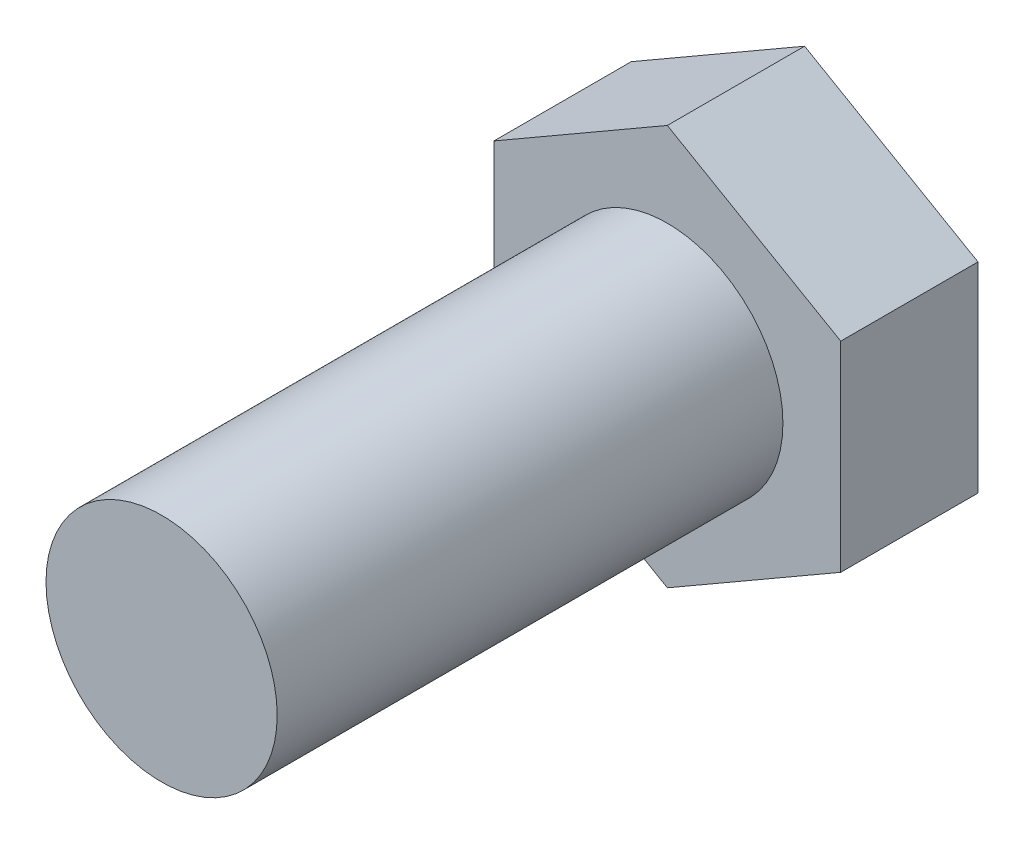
ISO-10303-21;
HEADER;
FILE_DESCRIPTION(('STEP AP214'),'2;1');
FILE_NAME('part.step','',(''),(''),'','','');
FILE_SCHEMA(('AUTOMOTIVE_DESIGN { 1 0 10303 214 1 1 1 1 }'));
ENDSEC;
DATA;
#1=APPLICATION_CONTEXT('core data for automotive mechanical design processes');
#2=APPLICATION_PROTOCOL_DEFINITION('international standard','automotive_design',2000,#1);
#3=PRODUCT_CONTEXT('',#1,'mechanical');
#4=PRODUCT('Part','Part','',(#3));
#5=PRODUCT_RELATED_PRODUCT_CATEGORY('part','',(#4));
#6=PRODUCT_DEFINITION_FORMATION('','',#4);
#7=PRODUCT_DEFINITION_CONTEXT('part definition',#1,'design');
#8=PRODUCT_DEFINITION('design','',#6,#7);
#9=PRODUCT_DEFINITION_SHAPE('','',#8);
#10=(LENGTH_UNIT() NAMED_UNIT(*) SI_UNIT(.MILLI.,.METRE.));
#11=(NAMED_UNIT(*) PLANE_ANGLE_UNIT() SI_UNIT($,.RADIAN.));
#12=(NAMED_UNIT(*) SI_UNIT($,.STERADIAN.) SOLID_ANGLE_UNIT());
#13=UNCERTAINTY_MEASURE_WITH_UNIT(LENGTH_MEASURE(1.E-05),#10,'distance_accuracy_value','');
#14=(GEOMETRIC_REPRESENTATION_CONTEXT(3) GLOBAL_UNCERTAINTY_ASSIGNED_CONTEXT((#13)) GLOBAL_UNIT_ASSIGNED_CONTEXT((#10,
#11,#12)) REPRESENTATION_CONTEXT('',''));
#15=CARTESIAN_POINT('',(0.,0.,0.));
#16=DIRECTION('',(0.,0.,1.));
#17=DIRECTION('',(1.,0.,0.));
#18=AXIS2_PLACEMENT_3D('',#15,#16,#17);
#19=CARTESIAN_POINT('',(0.,0.,46.));
#20=DIRECTION('',(0.,0.,-1.));
#21=DIRECTION('',(-1.,0.,0.));
#22=AXIS2_PLACEMENT_3D('',#19,#20,#21);
#23=PLANE('',#22);
#24=CARTESIAN_POINT('',(0.,0.,46.));
#25=DIRECTION('',(0.,0.,-1.));
#26=DIRECTION('',(-1.,0.,0.));
#27=AXIS2_PLACEMENT_3D('',#24,#25,#26);
#28=CIRCLE('',#27,8.);
#29=CARTESIAN_POINT('',(-8.,0.,46.));
#30=VERTEX_POINT('',#29);
#31=EDGE_CURVE('E22',#30,#30,#28,.T.);
#32=ORIENTED_EDGE('',*,*,#31,.F.);
#33=EDGE_LOOP('',(#32));
#34=FACE_BOUND('',#33,.T.);
#35=ADVANCED_FACE('F15',(#34),#23,.F.);
#36=CARTESIAN_POINT('',(0.,0.,-24.));
#37=DIRECTION('',(0.,0.,-1.));
#38=DIRECTION('',(-1.,0.,0.));
#39=AXIS2_PLACEMENT_3D('',#36,#37,#38);
#40=CYLINDRICAL_SURFACE('',#39,8.);
#41=CARTESIAN_POINT('',(0.,0.,11.));
#42=DIRECTION('',(0.,0.,-1.));
#43=DIRECTION('',(-1.,0.,0.));
#44=AXIS2_PLACEMENT_3D('',#41,#42,#43);
#45=CIRCLE('',#44,8.);
#46=CARTESIAN_POINT('',(-8.,0.,11.));
#47=VERTEX_POINT('',#46);
#48=EDGE_CURVE('E110',#47,#47,#45,.T.);
#49=ORIENTED_EDGE('',*,*,#48,.F.);
#50=EDGE_LOOP('',(#49));
#51=FACE_BOUND('',#50,.T.);
#52=ORIENTED_EDGE('',*,*,#31,.T.);
#53=EDGE_LOOP('',(#52));
#54=FACE_BOUND('',#53,.T.);
#55=ADVANCED_FACE('F154',(#51,#54),#40,.T.);
#56=CARTESIAN_POINT('',(-8.,0.,11.));
#57=DIRECTION('',(0.,0.,-1.));
#58=DIRECTION('',(-1.,0.,0.));
#59=AXIS2_PLACEMENT_3D('',#56,#57,#58);
#60=PLANE('',#59);
#61=DIRECTION('',(0.866025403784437,-0.5,0.));
#62=VECTOR('',#61,1.);
#63=CARTESIAN_POINT('',(0.,13.856406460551,11.));
#64=LINE('',#63,#62);
#65=CARTESIAN_POINT('',(0.,13.8564064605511,11.));
#66=VERTEX_POINT('',#65);
#67=CARTESIAN_POINT('',(12.,6.92820323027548,11.));
#68=VERTEX_POINT('',#67);
#69=EDGE_CURVE('E81',#66,#68,#64,.T.);
#70=ORIENTED_EDGE('',*,*,#69,.F.);
#71=DIRECTION('',(-0.866025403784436,-0.5,0.));
#72=VECTOR('',#71,1.);
#73=CARTESIAN_POINT('',(-12.,6.92820323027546,11.));
#74=LINE('',#73,#72);
#75=CARTESIAN_POINT('',(-12.,6.92820323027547,11.));
#76=VERTEX_POINT('',#75);
#77=EDGE_CURVE('E107',#66,#76,#74,.T.);
#78=ORIENTED_EDGE('',*,*,#77,.T.);
#79=DIRECTION('',(0.,-1.,0.));
#80=VECTOR('',#79,1.);
#81=CARTESIAN_POINT('',(-12.,0.,11.));
#82=LINE('',#81,#80);
#83=CARTESIAN_POINT('',(-12.,-6.92820323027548,11.));
#84=VERTEX_POINT('',#83);
#85=EDGE_CURVE('E104',#76,#84,#82,.T.);
#86=ORIENTED_EDGE('',*,*,#85,.T.);
#87=DIRECTION('',(-0.866025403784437,0.5,0.));
#88=VECTOR('',#87,1.);
#89=CARTESIAN_POINT('',(-12.,-6.92820323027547,11.));
#90=LINE('',#89,#88);
#91=CARTESIAN_POINT('',(0.,-13.8564064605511,11.));
#92=VERTEX_POINT('',#91);
#93=EDGE_CURVE('E102',#92,#84,#90,.T.);
#94=ORIENTED_EDGE('',*,*,#93,.F.);
#95=DIRECTION('',(0.866025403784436,0.5,0.));
#96=VECTOR('',#95,1.);
#97=CARTESIAN_POINT('',(0.,-13.856406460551,11.));
#98=LINE('',#97,#96);
#99=CARTESIAN_POINT('',(12.,-6.92820323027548,11.));
#100=VERTEX_POINT('',#99);
#101=EDGE_CURVE('E99',#92,#100,#98,.T.);
#102=ORIENTED_EDGE('',*,*,#101,.T.);
#103=DIRECTION('',(0.,-1.,0.));
#104=VECTOR('',#103,1.);
#105=CARTESIAN_POINT('',(12.,0.,11.));
#106=LINE('',#105,#104);
#107=EDGE_CURVE('E97',#68,#100,#106,.T.);
#108=ORIENTED_EDGE('',*,*,#107,.F.);
#109=EDGE_LOOP('',(#70,#78,#86,#94,#102,#108));
#110=FACE_BOUND('',#109,.T.);
#111=ORIENTED_EDGE('',*,*,#48,.T.);
#112=EDGE_LOOP('',(#111));
#113=FACE_BOUND('',#112,.T.);
#114=ADVANCED_FACE('F136',(#110,#113),#60,.F.);
#115=CARTESIAN_POINT('',(0.,13.8564064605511,12.));
#116=DIRECTION('',(0.5,-0.866025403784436,0.));
#117=DIRECTION('',(-0.866025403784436,-0.5,0.));
#118=AXIS2_PLACEMENT_3D('',#115,#116,#117);
#119=PLANE('',#118);
#120=DIRECTION('',(0.,0.,-1.));
#121=VECTOR('',#120,1.);
#122=CARTESIAN_POINT('',(0.,13.8564064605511,12.));
#123=LINE('',#122,#121);
#124=CARTESIAN_POINT('',(0.,13.8564064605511,1.5));
#125=VERTEX_POINT('',#124);
#126=EDGE_CURVE('E35',#66,#125,#123,.T.);
#127=ORIENTED_EDGE('',*,*,#126,.T.);
#128=DIRECTION('',(-0.866025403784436,-0.5,0.));
#129=VECTOR('',#128,1.);
#130=CARTESIAN_POINT('',(0.,13.8564064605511,1.5));
#131=LINE('',#130,#129);
#132=CARTESIAN_POINT('',(-12.,6.92820323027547,1.5));
#133=VERTEX_POINT('',#132);
#134=EDGE_CURVE('E28',#125,#133,#131,.T.);
#135=ORIENTED_EDGE('',*,*,#134,.T.);
#136=DIRECTION('',(0.,0.,-1.));
#137=VECTOR('',#136,1.);
#138=CARTESIAN_POINT('',(-12.,6.92820323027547,12.));
#139=LINE('',#138,#137);
#140=EDGE_CURVE('E93',#76,#133,#139,.T.);
#141=ORIENTED_EDGE('',*,*,#140,.F.);
#142=ORIENTED_EDGE('',*,*,#77,.F.);
#143=EDGE_LOOP('',(#127,#135,#141,#142));
#144=FACE_BOUND('',#143,.T.);
#145=ADVANCED_FACE('F130',(#144),#119,.F.);
#146=CARTESIAN_POINT('',(-12.,6.92820323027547,12.));
#147=DIRECTION('',(1.,0.,0.));
#148=DIRECTION('',(0.,0.,-1.));
#149=AXIS2_PLACEMENT_3D('',#146,#147,#148);
#150=PLANE('',#149);
#151=ORIENTED_EDGE('',*,*,#140,.T.);
#152=DIRECTION('',(0.,-1.,0.));
#153=VECTOR('',#152,1.);
#154=CARTESIAN_POINT('',(-12.,6.92820323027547,1.5));
#155=LINE('',#154,#153);
#156=CARTESIAN_POINT('',(-12.,-6.92820323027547,1.5));
#157=VERTEX_POINT('',#156);
#158=EDGE_CURVE('E126',#133,#157,#155,.T.);
#159=ORIENTED_EDGE('',*,*,#158,.T.);
#160=DIRECTION('',(0.,0.,-1.));
#161=VECTOR('',#160,1.);
#162=CARTESIAN_POINT('',(-12.,-6.92820323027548,12.));
#163=LINE('',#162,#161);
#164=EDGE_CURVE('E90',#84,#157,#163,.T.);
#165=ORIENTED_EDGE('',*,*,#164,.F.);
#166=ORIENTED_EDGE('',*,*,#85,.F.);
#167=EDGE_LOOP('',(#151,#159,#165,#166));
#168=FACE_BOUND('',#167,.T.);
#169=ADVANCED_FACE('F132',(#168),#150,.F.);
#170=CARTESIAN_POINT('',(0.,-13.8564064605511,12.));
#171=DIRECTION('',(-0.5,-0.866025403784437,0.));
#172=DIRECTION('',(-0.866025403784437,0.5,0.));
#173=AXIS2_PLACEMENT_3D('',#170,#171,#172);
#174=PLANE('',#173);
#175=DIRECTION('',(-0.866025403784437,0.5,0.));
#176=VECTOR('',#175,1.);
#177=CARTESIAN_POINT('',(0.,-13.8564064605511,1.5));
#178=LINE('',#177,#176);
#179=CARTESIAN_POINT('',(0.,-13.8564064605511,1.5));
#180=VERTEX_POINT('',#179);
#181=EDGE_CURVE('E124',#180,#157,#178,.T.);
#182=ORIENTED_EDGE('',*,*,#181,.F.);
#183=DIRECTION('',(0.,0.,-1.));
#184=VECTOR('',#183,1.);
#185=CARTESIAN_POINT('',(0.,-13.8564064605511,12.));
#186=LINE('',#185,#184);
#187=EDGE_CURVE('E83',#92,#180,#186,.T.);
#188=ORIENTED_EDGE('',*,*,#187,.F.);
#189=ORIENTED_EDGE('',*,*,#93,.T.);
#190=ORIENTED_EDGE('',*,*,#164,.T.);
#191=EDGE_LOOP('',(#182,#188,#189,#190));
#192=FACE_BOUND('',#191,.T.);
#193=ADVANCED_FACE('F143',(#192),#174,.T.);
#194=CARTESIAN_POINT('',(0.,-13.8564064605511,12.));
#195=DIRECTION('',(-0.5,0.866025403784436,0.));
#196=DIRECTION('',(0.866025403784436,0.5,0.));
#197=AXIS2_PLACEMENT_3D('',#194,#195,#196);
#198=PLANE('',#197);
#199=ORIENTED_EDGE('',*,*,#187,.T.);
#200=DIRECTION('',(0.866025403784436,0.5,0.));
#201=VECTOR('',#200,1.);
#202=CARTESIAN_POINT('',(0.,-13.8564064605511,1.5));
#203=LINE('',#202,#201);
#204=CARTESIAN_POINT('',(12.,-6.92820323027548,1.5));
#205=VERTEX_POINT('',#204);
#206=EDGE_CURVE('E76',#180,#205,#203,.T.);
#207=ORIENTED_EDGE('',*,*,#206,.T.);
#208=DIRECTION('',(0.,0.,-1.));
#209=VECTOR('',#208,1.);
#210=CARTESIAN_POINT('',(12.,-6.92820323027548,12.));
#211=LINE('',#210,#209);
#212=EDGE_CURVE('E75',#100,#205,#211,.T.);
#213=ORIENTED_EDGE('',*,*,#212,.F.);
#214=ORIENTED_EDGE('',*,*,#101,.F.);
#215=EDGE_LOOP('',(#199,#207,#213,#214));
#216=FACE_BOUND('',#215,.T.);
#217=ADVANCED_FACE('F139',(#216),#198,.F.);
#218=CARTESIAN_POINT('',(12.,6.92820323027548,12.));
#219=DIRECTION('',(1.,0.,0.));
#220=DIRECTION('',(0.,0.,-1.));
#221=AXIS2_PLACEMENT_3D('',#218,#219,#220);
#222=PLANE('',#221);
#223=DIRECTION('',(0.,-1.,0.));
#224=VECTOR('',#223,1.);
#225=CARTESIAN_POINT('',(12.,6.92820323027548,1.5));
#226=LINE('',#225,#224);
#227=CARTESIAN_POINT('',(12.,6.92820323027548,1.5));
#228=VERTEX_POINT('',#227);
#229=EDGE_CURVE('E65',#228,#205,#226,.T.);
#230=ORIENTED_EDGE('',*,*,#229,.F.);
#231=DIRECTION('',(0.,0.,-1.));
#232=VECTOR('',#231,1.);
#233=CARTESIAN_POINT('',(12.,6.92820323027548,12.));
#234=LINE('',#233,#232);
#235=EDGE_CURVE('E72',#68,#228,#234,.T.);
#236=ORIENTED_EDGE('',*,*,#235,.F.);
#237=ORIENTED_EDGE('',*,*,#107,.T.);
#238=ORIENTED_EDGE('',*,*,#212,.T.);
#239=EDGE_LOOP('',(#230,#236,#237,#238));
#240=FACE_BOUND('',#239,.T.);
#241=ADVANCED_FACE('F71',(#240),#222,.T.);
#242=CARTESIAN_POINT('',(0.,13.8564064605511,12.));
#243=DIRECTION('',(0.5,0.866025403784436,0.));
#244=DIRECTION('',(0.866025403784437,-0.5,0.));
#245=AXIS2_PLACEMENT_3D('',#242,#243,#244);
#246=PLANE('',#245);
#247=DIRECTION('',(0.866025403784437,-0.5,0.));
#248=VECTOR('',#247,1.);
#249=CARTESIAN_POINT('',(0.,13.8564064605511,1.5));
#250=LINE('',#249,#248);
#251=EDGE_CURVE('E9',#125,#228,#250,.T.);
#252=ORIENTED_EDGE('',*,*,#251,.F.);
#253=ORIENTED_EDGE('',*,*,#126,.F.);
#254=ORIENTED_EDGE('',*,*,#69,.T.);
#255=ORIENTED_EDGE('',*,*,#235,.T.);
#256=EDGE_LOOP('',(#252,#253,#254,#255));
#257=FACE_BOUND('',#256,.T.);
#258=ADVANCED_FACE('F79',(#257),#246,.T.);
#259=CARTESIAN_POINT('',(0.,16.05,1.5));
#260=DIRECTION('',(0.,0.,1.));
#261=DIRECTION('',(1.,0.,0.));
#262=AXIS2_PLACEMENT_3D('',#259,#260,#261);
#263=PLANE('',#262);
#264=CARTESIAN_POINT('',(0.,0.,1.5));
#265=DIRECTION('',(0.,0.,-1.));
#266=DIRECTION('',(-1.,0.,0.));
#267=AXIS2_PLACEMENT_3D('',#264,#265,#266);
#268=CIRCLE('',#267,9.5);
#269=CARTESIAN_POINT('',(-9.5,0.,1.5));
#270=VERTEX_POINT('',#269);
#271=EDGE_CURVE('E115',#270,#270,#268,.T.);
#272=ORIENTED_EDGE('',*,*,#271,.F.);
#273=EDGE_LOOP('',(#272));
#274=FACE_BOUND('',#273,.T.);
#275=ORIENTED_EDGE('',*,*,#251,.T.);
#276=ORIENTED_EDGE('',*,*,#229,.T.);
#277=ORIENTED_EDGE('',*,*,#206,.F.);
#278=ORIENTED_EDGE('',*,*,#181,.T.);
#279=ORIENTED_EDGE('',*,*,#158,.F.);
#280=ORIENTED_EDGE('',*,*,#134,.F.);
#281=EDGE_LOOP('',(#275,#276,#277,#278,#279,#280));
#282=FACE_BOUND('',#281,.T.);
#283=ADVANCED_FACE('F64',(#274,#282),#263,.F.);
#284=CARTESIAN_POINT('',(0.,0.,6.));
#285=DIRECTION('',(0.,0.,-1.));
#286=DIRECTION('',(-1.,0.,0.));
#287=AXIS2_PLACEMENT_3D('',#284,#285,#286);
#288=CYLINDRICAL_SURFACE('',#287,9.5);
#289=ORIENTED_EDGE('',*,*,#271,.T.);
#290=EDGE_LOOP('',(#289));
#291=FACE_BOUND('',#290,.T.);
#292=CARTESIAN_POINT('',(0.,0.,0.));
#293=DIRECTION('',(0.,0.,1.));
#294=DIRECTION('',(1.,0.,0.));
#295=AXIS2_PLACEMENT_3D('',#292,#293,#294);
#296=CIRCLE('',#295,9.5);
#297=CARTESIAN_POINT('',(9.5,0.,0.));
#298=VERTEX_POINT('',#297);
#299=EDGE_CURVE('E77',#298,#298,#296,.T.);
#300=ORIENTED_EDGE('',*,*,#299,.T.);
#301=EDGE_LOOP('',(#300));
#302=FACE_BOUND('',#301,.T.);
#303=ADVANCED_FACE('F170',(#291,#302),#288,.T.);
#304=CARTESIAN_POINT('',(-14.,0.,0.));
#305=DIRECTION('',(0.,0.,1.));
#306=DIRECTION('',(1.,0.,0.));
#307=AXIS2_PLACEMENT_3D('',#304,#305,#306);
#308=PLANE('',#307);
#309=ORIENTED_EDGE('',*,*,#299,.F.);
#310=EDGE_LOOP('',(#309));
#311=FACE_BOUND('',#310,.T.);
#312=ADVANCED_FACE('F168',(#311),#308,.F.);
#313=CLOSED_SHELL('',(#35,#55,#114,#145,#169,#193,#217,#241,#258,#283,#303,#312));
#314=MANIFOLD_SOLID_BREP('B1',#313);
#315=ADVANCED_BREP_SHAPE_REPRESENTATION('',(#18,#314),#14);
#316=SHAPE_DEFINITION_REPRESENTATION(#9,#315);
ENDSEC;
END-ISO-10303-21;
